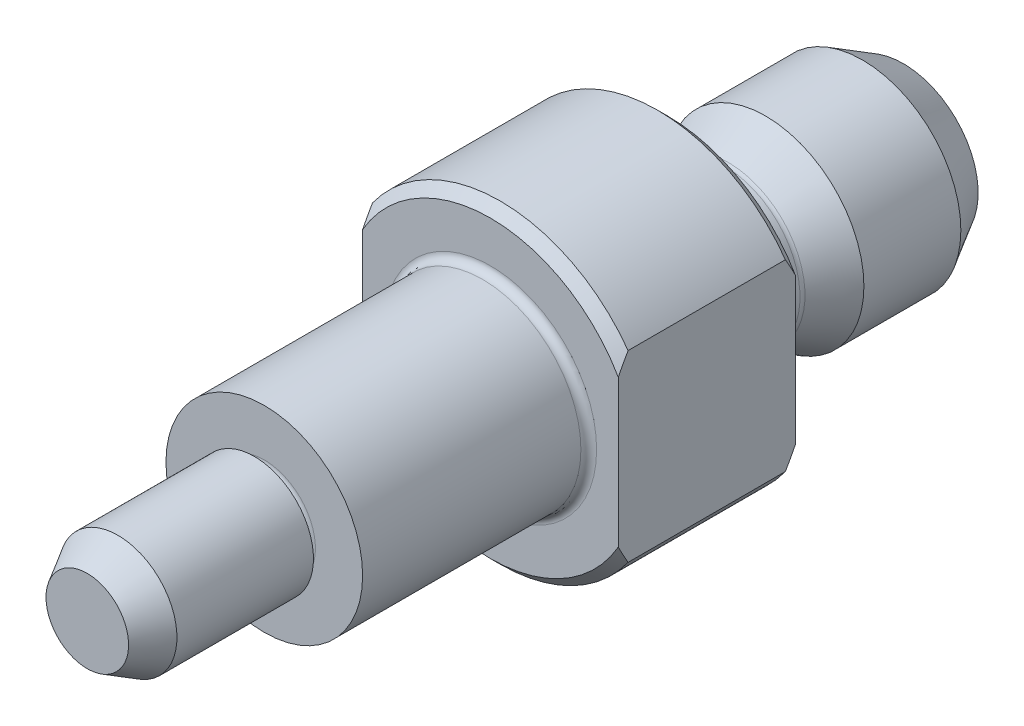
ISO-10303-21;
HEADER;
FILE_DESCRIPTION(('STEP AP214'),'2;1');
FILE_NAME('part.step','',(''),(''),'','','');
FILE_SCHEMA(('AUTOMOTIVE_DESIGN { 1 0 10303 214 1 1 1 1 }'));
ENDSEC;
DATA;
#1=APPLICATION_CONTEXT('core data for automotive mechanical design processes');
#2=APPLICATION_PROTOCOL_DEFINITION('international standard','automotive_design',2000,#1);
#3=PRODUCT_CONTEXT('',#1,'mechanical');
#4=PRODUCT('Part','Part','',(#3));
#5=PRODUCT_RELATED_PRODUCT_CATEGORY('part','',(#4));
#6=PRODUCT_DEFINITION_FORMATION('','',#4);
#7=PRODUCT_DEFINITION_CONTEXT('part definition',#1,'design');
#8=PRODUCT_DEFINITION('design','',#6,#7);
#9=PRODUCT_DEFINITION_SHAPE('','',#8);
#10=(LENGTH_UNIT() NAMED_UNIT(*) SI_UNIT(.MILLI.,.METRE.));
#11=(NAMED_UNIT(*) PLANE_ANGLE_UNIT() SI_UNIT($,.RADIAN.));
#12=(NAMED_UNIT(*) SI_UNIT($,.STERADIAN.) SOLID_ANGLE_UNIT());
#13=UNCERTAINTY_MEASURE_WITH_UNIT(LENGTH_MEASURE(1.E-05),#10,'distance_accuracy_value','');
#14=(GEOMETRIC_REPRESENTATION_CONTEXT(3) GLOBAL_UNCERTAINTY_ASSIGNED_CONTEXT((#13)) GLOBAL_UNIT_ASSIGNED_CONTEXT((#10,
#11,#12)) REPRESENTATION_CONTEXT('',''));
#15=CARTESIAN_POINT('',(0.,0.,0.));
#16=DIRECTION('',(0.,0.,1.));
#17=DIRECTION('',(1.,0.,0.));
#18=AXIS2_PLACEMENT_3D('',#15,#16,#17);
#19=CARTESIAN_POINT('',(0.,4.25000000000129,0.));
#20=DIRECTION('',(0.,0.,-1.));
#21=DIRECTION('',(-1.,0.,0.));
#22=AXIS2_PLACEMENT_3D('',#19,#20,#21);
#23=PLANE('',#22);
#24=CARTESIAN_POINT('',(0.,0.,0.));
#25=DIRECTION('',(0.,0.,-1.));
#26=DIRECTION('',(-1.,0.,0.));
#27=AXIS2_PLACEMENT_3D('',#24,#25,#26);
#28=CIRCLE('',#27,4.25000000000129);
#29=CARTESIAN_POINT('',(-4.25000000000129,0.,0.));
#30=VERTEX_POINT('',#29);
#31=EDGE_CURVE('E111',#30,#30,#28,.T.);
#32=ORIENTED_EDGE('',*,*,#31,.F.);
#33=EDGE_LOOP('',(#32));
#34=FACE_BOUND('',#33,.T.);
#35=CARTESIAN_POINT('',(0.,0.,0.));
#36=DIRECTION('',(0.,0.,-1.));
#37=DIRECTION('',(-1.,0.,0.));
#38=AXIS2_PLACEMENT_3D('',#35,#36,#37);
#39=CIRCLE('',#38,7.5);
#40=CARTESIAN_POINT('',(-6.5,3.74165738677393,0.));
#41=VERTEX_POINT('',#40);
#42=CARTESIAN_POINT('',(6.5,3.74165738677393,0.));
#43=VERTEX_POINT('',#42);
#44=EDGE_CURVE('E108',#41,#43,#39,.T.);
#45=ORIENTED_EDGE('',*,*,#44,.T.);
#46=DIRECTION('',(0.,-1.,0.));
#47=VECTOR('',#46,1.);
#48=CARTESIAN_POINT('',(6.5,4.6636895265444,0.));
#49=LINE('',#48,#47);
#50=CARTESIAN_POINT('',(6.5,-3.74165738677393,0.));
#51=VERTEX_POINT('',#50);
#52=EDGE_CURVE('E408',#43,#51,#49,.T.);
#53=ORIENTED_EDGE('',*,*,#52,.T.);
#54=CARTESIAN_POINT('',(-6.5,-3.74165738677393,0.));
#55=VERTEX_POINT('',#54);
#56=EDGE_CURVE('E107',#51,#55,#39,.T.);
#57=ORIENTED_EDGE('',*,*,#56,.T.);
#58=DIRECTION('',(0.,1.,0.));
#59=VECTOR('',#58,1.);
#60=CARTESIAN_POINT('',(-6.5,4.6636895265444,0.));
#61=LINE('',#60,#59);
#62=EDGE_CURVE('E91',#55,#41,#61,.T.);
#63=ORIENTED_EDGE('',*,*,#62,.T.);
#64=EDGE_LOOP('',(#45,#53,#57,#63));
#65=FACE_BOUND('',#64,.T.);
#66=ADVANCED_FACE('F14',(#34,#65),#23,.T.);
#67=CARTESIAN_POINT('',(0.,0.,0.));
#68=DIRECTION('',(0.,0.,1.));
#69=DIRECTION('',(1.,0.,0.));
#70=AXIS2_PLACEMENT_3D('',#67,#68,#69);
#71=CONICAL_SURFACE('',#70,7.5,0.785398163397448);
#72=ORIENTED_EDGE('',*,*,#56,.F.);
#73=CARTESIAN_POINT('',(6.5,-0.448442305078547,-0.9845490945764));
#74=CARTESIAN_POINT('',(6.5,-0.554436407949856,-0.977262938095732));
#75=CARTESIAN_POINT('',(6.5,-0.660232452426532,-0.967396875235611));
#76=CARTESIAN_POINT('',(6.5,-0.87121683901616,-0.942708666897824));
#77=CARTESIAN_POINT('',(6.5,-0.976405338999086,-0.927887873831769));
#78=CARTESIAN_POINT('',(6.5,-1.29037820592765,-0.876364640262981));
#79=CARTESIAN_POINT('',(6.5,-1.49802720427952,-0.832568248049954));
#80=CARTESIAN_POINT('',(6.5,-1.906698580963,-0.728973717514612));
#81=CARTESIAN_POINT('',(6.5,-2.10776929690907,-0.669361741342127));
#82=CARTESIAN_POINT('',(6.5,-2.50533852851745,-0.536408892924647));
#83=CARTESIAN_POINT('',(6.5,-2.70183584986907,-0.463064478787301));
#84=CARTESIAN_POINT('',(6.5,-3.0217554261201,-0.332865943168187));
#85=CARTESIAN_POINT('',(6.5,-3.14653861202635,-0.27930281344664));
#86=CARTESIAN_POINT('',(6.5,-3.33245316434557,-0.195743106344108));
#87=CARTESIAN_POINT('',(6.5,-3.39429257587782,-0.167315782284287));
#88=CARTESIAN_POINT('',(6.5,-3.51750334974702,-0.109473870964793));
#89=CARTESIAN_POINT('',(6.5,-3.57887473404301,-0.0800593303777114));
#90=CARTESIAN_POINT('',(6.5,-3.93683654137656,0.0948343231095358));
#91=CARTESIAN_POINT('',(6.5,-4.22838435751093,0.250719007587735));
#92=CARTESIAN_POINT('',(6.5,-4.80252151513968,0.57828162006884));
#93=CARTESIAN_POINT('',(6.5,-5.08510521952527,0.74996923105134));
#94=CARTESIAN_POINT('',(6.5,-5.64369197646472,1.10550730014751));
#95=CARTESIAN_POINT('',(6.5,-5.91967220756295,1.28939342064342));
#96=CARTESIAN_POINT('',(6.5,-6.46548469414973,1.66588745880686));
#97=CARTESIAN_POINT('',(6.5,-6.73531832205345,1.85849340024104));
#98=CARTESIAN_POINT('',(6.5,-7.263233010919,2.24541762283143));
#99=CARTESIAN_POINT('',(6.5,-7.52143831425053,2.43956706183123));
#100=CARTESIAN_POINT('',(6.5,-8.03402105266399,2.83288508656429));
#101=CARTESIAN_POINT('',(6.5,-8.28839816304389,3.03205409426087));
#102=CARTESIAN_POINT('',(6.5,-8.79211203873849,3.43289007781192));
#103=CARTESIAN_POINT('',(6.5,-9.0414721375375,3.6345278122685));
#104=CARTESIAN_POINT('',(6.5,-9.53750816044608,4.0409767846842));
#105=CARTESIAN_POINT('',(6.5,-9.78418463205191,4.24578735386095));
#106=CARTESIAN_POINT('',(6.5,-10.0297939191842,4.45185199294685));
#107=B_SPLINE_CURVE_WITH_KNOTS('',3,(#73,#74,#75,#76,#77,#78,#79,#80,#81,#82,#83,#84,#85,#86,
#87,#88,#89,#90,#91,#92,#93,#94,#95,#96,#97,#98,#99,#100,#101,#102,#103,#104,#105,#106),
.UNSPECIFIED.,.F.,.F.,(4,2,2,2,2,2,2,2,2,2,2,2,2,2,2,2,4),(0.,0.318664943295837,
0.637242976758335,1.27302900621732,1.90164000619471,2.53041336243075,2.93771707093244,
3.14188952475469,3.34605233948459,4.33706569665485,5.32869037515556,6.323354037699,
7.31779339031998,8.28688010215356,9.25604855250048,10.2180718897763,11.1798951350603),.UNSPECIFIED.);
#108=CARTESIAN_POINT('',(6.5,-4.6636895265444,0.5));
#109=VERTEX_POINT('',#108);
#110=EDGE_CURVE('E464',#51,#109,#107,.T.);
#111=ORIENTED_EDGE('',*,*,#110,.T.);
#112=CARTESIAN_POINT('',(0.,0.,0.5));
#113=DIRECTION('',(0.,0.,-1.));
#114=DIRECTION('',(-1.,0.,0.));
#115=AXIS2_PLACEMENT_3D('',#112,#113,#114);
#116=CIRCLE('',#115,8.);
#117=CARTESIAN_POINT('',(-6.5,-4.6636895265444,0.5));
#118=VERTEX_POINT('',#117);
#119=EDGE_CURVE('E103',#109,#118,#116,.T.);
#120=ORIENTED_EDGE('',*,*,#119,.T.);
#121=CARTESIAN_POINT('',(-6.5,-10.0297939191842,4.45185199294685));
#122=CARTESIAN_POINT('',(-6.5,-9.77580964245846,4.23876654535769));
#123=CARTESIAN_POINT('',(-6.5,-9.52068711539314,4.02701683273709));
#124=CARTESIAN_POINT('',(-6.5,-9.00755072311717,3.60693105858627));
#125=CARTESIAN_POINT('',(-6.5,-8.74953620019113,3.398595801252));
#126=CARTESIAN_POINT('',(-6.5,-8.22831564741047,2.98474942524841));
#127=CARTESIAN_POINT('',(-6.5,-7.96508601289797,2.77926794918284));
#128=CARTESIAN_POINT('',(-6.5,-7.43445589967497,2.37379363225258));
#129=CARTESIAN_POINT('',(-6.5,-7.16705579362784,2.17380030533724));
#130=CARTESIAN_POINT('',(-6.5,-6.63798977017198,1.78877409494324));
#131=CARTESIAN_POINT('',(-6.5,-6.37652699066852,1.60346310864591));
#132=CARTESIAN_POINT('',(-6.5,-5.84774950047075,1.24122617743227));
#133=CARTESIAN_POINT('',(-6.5,-5.58043372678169,1.0643017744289));
#134=CARTESIAN_POINT('',(-6.5,-5.03931289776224,0.721972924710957));
#135=CARTESIAN_POINT('',(-6.5,-4.76552352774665,0.556543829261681));
#136=CARTESIAN_POINT('',(-6.5,-4.20948094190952,0.240630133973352));
#137=CARTESIAN_POINT('',(-6.5,-3.92723176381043,0.0901385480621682));
#138=CARTESIAN_POINT('',(-6.5,-3.51578659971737,-0.110881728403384));
#139=CARTESIAN_POINT('',(-6.5,-3.39062252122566,-0.169677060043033));
#140=CARTESIAN_POINT('',(-6.5,-3.13834790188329,-0.282902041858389));
#141=CARTESIAN_POINT('',(-6.5,-3.01123741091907,-0.337331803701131));
#142=CARTESIAN_POINT('',(-6.5,-2.62717157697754,-0.493051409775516));
#143=CARTESIAN_POINT('',(-6.5,-2.3671028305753,-0.586960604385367));
#144=CARTESIAN_POINT('',(-6.5,-1.96906704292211,-0.709495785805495));
#145=CARTESIAN_POINT('',(-6.5,-1.8339537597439,-0.747514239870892));
#146=CARTESIAN_POINT('',(-6.5,-1.56189192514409,-0.816274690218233));
#147=CARTESIAN_POINT('',(-6.5,-1.42494369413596,-0.847017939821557));
#148=CARTESIAN_POINT('',(-6.5,-1.14875341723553,-0.900664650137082));
#149=CARTESIAN_POINT('',(-6.5,-1.00950305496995,-0.923525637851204));
#150=CARTESIAN_POINT('',(-6.5,-0.72976611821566,-0.960642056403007));
#151=CARTESIAN_POINT('',(-6.5,-0.589278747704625,-0.974891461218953));
#152=CARTESIAN_POINT('',(-6.5,-0.448442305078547,-0.9845490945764));
#153=B_SPLINE_CURVE_WITH_KNOTS('',3,(#121,#122,#123,#124,#125,#126,#127,#128,#129,#130,#131,
#132,#133,#134,#135,#136,#137,#138,#139,#140,#141,#142,#143,#144,#145,#146,#147,#148,#149,#150,
#151,#152),.UNSPECIFIED.,.F.,.F.,(4,2,2,2,2,2,2,2,2,2,2,2,2,2,2,4),(0.,0.994611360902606,
1.98945370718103,2.99120180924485,3.99286090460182,4.95415669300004,5.9156285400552,
6.87497072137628,7.83386209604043,8.24864290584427,8.66341310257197,9.49168550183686,
9.91260568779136,10.3334533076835,10.7565344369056,11.1799112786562),.UNSPECIFIED.);
#154=EDGE_CURVE('E440',#118,#55,#153,.T.);
#155=ORIENTED_EDGE('',*,*,#154,.T.);
#156=EDGE_LOOP('',(#72,#111,#120,#155));
#157=FACE_BOUND('',#156,.T.);
#158=ADVANCED_FACE('F154',(#157),#71,.T.);
#159=CARTESIAN_POINT('',(-6.5,4.6636895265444,0.5));
#160=VERTEX_POINT('',#159);
#161=CARTESIAN_POINT('',(6.5,4.6636895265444,0.5));
#162=VERTEX_POINT('',#161);
#163=EDGE_CURVE('E104',#160,#162,#116,.T.);
#164=ORIENTED_EDGE('',*,*,#163,.T.);
#165=CARTESIAN_POINT('',(6.5,10.0297939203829,4.4518519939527));
#166=CARTESIAN_POINT('',(6.5,9.77580964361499,4.2387665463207));
#167=CARTESIAN_POINT('',(6.5,9.52068711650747,4.02701683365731));
#168=CARTESIAN_POINT('',(6.5,9.0075507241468,3.60693105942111));
#169=CARTESIAN_POINT('',(6.5,8.74953620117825,3.39859580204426));
#170=CARTESIAN_POINT('',(6.5,8.22831564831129,2.98474942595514));
#171=CARTESIAN_POINT('',(6.5,7.96508601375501,2.77926794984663));
#172=CARTESIAN_POINT('',(6.5,7.43445590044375,2.37379363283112));
#173=CARTESIAN_POINT('',(6.5,7.16705579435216,2.17380030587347));
#174=CARTESIAN_POINT('',(6.5,6.63798977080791,1.78877409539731));
#175=CARTESIAN_POINT('',(6.5,6.37652699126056,1.60346310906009));
#176=CARTESIAN_POINT('',(6.5,5.84774950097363,1.24122617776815));
#177=CARTESIAN_POINT('',(6.5,5.58043372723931,1.06430177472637));
#178=CARTESIAN_POINT('',(6.5,5.03931289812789,0.721972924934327));
#179=CARTESIAN_POINT('',(6.5,4.76552352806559,0.556543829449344));
#180=CARTESIAN_POINT('',(6.5,4.20948094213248,0.240630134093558));
#181=CARTESIAN_POINT('',(6.5,3.92723176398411,0.0901385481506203));
#182=CARTESIAN_POINT('',(6.5,3.51578659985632,-0.110881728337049));
#183=CARTESIAN_POINT('',(6.5,3.39062252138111,-0.16967705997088));
#184=CARTESIAN_POINT('',(6.5,3.13834790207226,-0.28290204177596));
#185=CARTESIAN_POINT('',(6.5,3.01123741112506,-0.337331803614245));
#186=CARTESIAN_POINT('',(6.5,2.62717157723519,-0.493051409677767));
#187=CARTESIAN_POINT('',(6.5,2.36710283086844,-0.586960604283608));
#188=CARTESIAN_POINT('',(6.5,1.9690670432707,-0.709495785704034));
#189=CARTESIAN_POINT('',(6.5,1.8339537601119,-0.747514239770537));
#190=CARTESIAN_POINT('',(6.5,1.56189192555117,-0.816274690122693));
#191=CARTESIAN_POINT('',(6.5,1.42494369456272,-0.847017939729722));
#192=CARTESIAN_POINT('',(6.5,1.14875341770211,-0.900664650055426));
#193=CARTESIAN_POINT('',(6.5,1.00950305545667,-0.923525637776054));
#194=CARTESIAN_POINT('',(6.5,0.729766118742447,-0.960642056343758));
#195=CARTESIAN_POINT('',(6.5,0.589278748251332,-0.974891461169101));
#196=CARTESIAN_POINT('',(6.5,0.448442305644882,-0.9845490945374));
#197=B_SPLINE_CURVE_WITH_KNOTS('',3,(#165,#166,#167,#168,#169,#170,#171,#172,#173,#174,#175,
#176,#177,#178,#179,#180,#181,#182,#183,#184,#185,#186,#187,#188,#189,#190,#191,#192,#193,#194,
#195,#196),.UNSPECIFIED.,.F.,.F.,(4,2,2,2,2,2,2,2,2,2,2,2,2,2,2,4),(0.,0.994611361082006,
1.98945370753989,2.99120180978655,3.99286090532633,4.95415669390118,5.91562854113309,
6.87497072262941,7.83386209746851,8.24864290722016,8.66341310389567,9.49168550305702,
9.91260568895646,10.3334533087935,10.7565344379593,11.1799112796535),.UNSPECIFIED.);
#198=EDGE_CURVE('E403',#162,#43,#197,.T.);
#199=ORIENTED_EDGE('',*,*,#198,.T.);
#200=ORIENTED_EDGE('',*,*,#44,.F.);
#201=CARTESIAN_POINT('',(-6.5,0.448442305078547,-0.9845490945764));
#202=CARTESIAN_POINT('',(-6.5,0.554436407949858,-0.977262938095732));
#203=CARTESIAN_POINT('',(-6.5,0.660232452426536,-0.967396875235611));
#204=CARTESIAN_POINT('',(-6.5,0.871216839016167,-0.942708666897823));
#205=CARTESIAN_POINT('',(-6.5,0.976405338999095,-0.927887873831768));
#206=CARTESIAN_POINT('',(-6.5,1.29037820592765,-0.876364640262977));
#207=CARTESIAN_POINT('',(-6.5,1.49802720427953,-0.832568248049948));
#208=CARTESIAN_POINT('',(-6.5,1.90669858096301,-0.728973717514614));
#209=CARTESIAN_POINT('',(-6.5,2.10776929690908,-0.669361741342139));
#210=CARTESIAN_POINT('',(-6.5,2.50533852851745,-0.536408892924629));
#211=CARTESIAN_POINT('',(-6.5,2.70183584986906,-0.463064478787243));
#212=CARTESIAN_POINT('',(-6.5,3.0217554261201,-0.332865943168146));
#213=CARTESIAN_POINT('',(-6.5,3.14653861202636,-0.279302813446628));
#214=CARTESIAN_POINT('',(-6.5,3.33245316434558,-0.195743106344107));
#215=CARTESIAN_POINT('',(-6.5,3.39429257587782,-0.167315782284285));
#216=CARTESIAN_POINT('',(-6.5,3.51750334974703,-0.109473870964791));
#217=CARTESIAN_POINT('',(-6.5,3.57887473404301,-0.0800593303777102));
#218=CARTESIAN_POINT('',(-6.5,3.93683654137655,0.0948343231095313));
#219=CARTESIAN_POINT('',(-6.5,4.22838435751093,0.250719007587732));
#220=CARTESIAN_POINT('',(-6.5,4.80252151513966,0.578281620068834));
#221=CARTESIAN_POINT('',(-6.5,5.08510521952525,0.74996923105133));
#222=CARTESIAN_POINT('',(-6.5,5.64369197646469,1.10550730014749));
#223=CARTESIAN_POINT('',(-6.5,5.91967220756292,1.2893934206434));
#224=CARTESIAN_POINT('',(-6.5,6.46548469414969,1.66588745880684));
#225=CARTESIAN_POINT('',(-6.5,6.73531832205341,1.85849340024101));
#226=CARTESIAN_POINT('',(-6.5,7.26323301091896,2.2454176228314));
#227=CARTESIAN_POINT('',(-6.5,7.5214383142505,2.43956706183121));
#228=CARTESIAN_POINT('',(-6.5,8.03402105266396,2.83288508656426));
#229=CARTESIAN_POINT('',(-6.5,8.28839816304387,3.03205409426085));
#230=CARTESIAN_POINT('',(-6.5,8.79211203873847,3.4328900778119));
#231=CARTESIAN_POINT('',(-6.5,9.04147213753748,3.63452781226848));
#232=CARTESIAN_POINT('',(-6.5,9.53750816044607,4.04097678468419));
#233=CARTESIAN_POINT('',(-6.5,9.7841846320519,4.24578735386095));
#234=CARTESIAN_POINT('',(-6.5,10.0297939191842,4.45185199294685));
#235=B_SPLINE_CURVE_WITH_KNOTS('',3,(#201,#202,#203,#204,#205,#206,#207,#208,#209,#210,#211,
#212,#213,#214,#215,#216,#217,#218,#219,#220,#221,#222,#223,#224,#225,#226,#227,#228,#229,#230,
#231,#232,#233,#234),.UNSPECIFIED.,.F.,.F.,(4,2,2,2,2,2,2,2,2,2,2,2,2,2,2,2,4),(0.,
0.318664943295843,0.637242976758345,1.27302900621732,1.90164000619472,2.53041336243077,
2.93771707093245,3.1418895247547,3.34605233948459,4.33706569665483,5.32869037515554,
6.32335403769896,7.31779339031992,8.28688010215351,9.25604855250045,10.2180718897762,
11.1798951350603),.UNSPECIFIED.);
#236=EDGE_CURVE('E404',#41,#160,#235,.T.);
#237=ORIENTED_EDGE('',*,*,#236,.T.);
#238=EDGE_LOOP('',(#164,#199,#200,#237));
#239=FACE_BOUND('',#238,.T.);
#240=ADVANCED_FACE('F161',(#239),#71,.T.);
#241=CARTESIAN_POINT('',(0.,0.,-25.8155281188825));
#242=DIRECTION('',(0.,0.,-1.));
#243=DIRECTION('',(-1.,0.,0.));
#244=AXIS2_PLACEMENT_3D('',#241,#242,#243);
#245=CYLINDRICAL_SURFACE('',#244,8.);
#246=ORIENTED_EDGE('',*,*,#119,.F.);
#247=DIRECTION('',(0.,0.,-1.));
#248=VECTOR('',#247,1.);
#249=CARTESIAN_POINT('',(6.5,-4.6636895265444,29.6155281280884));
#250=LINE('',#249,#248);
#251=CARTESIAN_POINT('',(6.5,-4.6636895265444,8.5));
#252=VERTEX_POINT('',#251);
#253=EDGE_CURVE('E409',#252,#109,#250,.T.);
#254=ORIENTED_EDGE('',*,*,#253,.F.);
#255=CARTESIAN_POINT('',(0.,0.,8.5));
#256=DIRECTION('',(0.,0.,-1.));
#257=DIRECTION('',(-1.,0.,0.));
#258=AXIS2_PLACEMENT_3D('',#255,#256,#257);
#259=CIRCLE('',#258,8.);
#260=CARTESIAN_POINT('',(-6.5,-4.6636895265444,8.5));
#261=VERTEX_POINT('',#260);
#262=EDGE_CURVE('E94',#252,#261,#259,.T.);
#263=ORIENTED_EDGE('',*,*,#262,.T.);
#264=DIRECTION('',(0.,0.,-1.));
#265=VECTOR('',#264,1.);
#266=CARTESIAN_POINT('',(-6.5,-4.6636895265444,29.6155281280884));
#267=LINE('',#266,#265);
#268=EDGE_CURVE('E417',#261,#118,#267,.T.);
#269=ORIENTED_EDGE('',*,*,#268,.T.);
#270=EDGE_LOOP('',(#246,#254,#263,#269));
#271=FACE_BOUND('',#270,.T.);
#272=ADVANCED_FACE('F345',(#271),#245,.T.);
#273=CARTESIAN_POINT('',(-6.5,4.6636895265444,8.5));
#274=VERTEX_POINT('',#273);
#275=CARTESIAN_POINT('',(6.5,4.6636895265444,8.5));
#276=VERTEX_POINT('',#275);
#277=EDGE_CURVE('E90',#274,#276,#259,.T.);
#278=ORIENTED_EDGE('',*,*,#277,.T.);
#279=DIRECTION('',(0.,0.,-1.));
#280=VECTOR('',#279,1.);
#281=CARTESIAN_POINT('',(6.5,4.6636895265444,29.6155281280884));
#282=LINE('',#281,#280);
#283=EDGE_CURVE('E407',#276,#162,#282,.T.);
#284=ORIENTED_EDGE('',*,*,#283,.T.);
#285=ORIENTED_EDGE('',*,*,#163,.F.);
#286=DIRECTION('',(0.,0.,-1.));
#287=VECTOR('',#286,1.);
#288=CARTESIAN_POINT('',(-6.5,4.6636895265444,29.6155281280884));
#289=LINE('',#288,#287);
#290=EDGE_CURVE('E406',#274,#160,#289,.T.);
#291=ORIENTED_EDGE('',*,*,#290,.F.);
#292=EDGE_LOOP('',(#278,#284,#285,#291));
#293=FACE_BOUND('',#292,.T.);
#294=ADVANCED_FACE('F336',(#293),#245,.T.);
#295=CARTESIAN_POINT('',(0.,0.,8.5));
#296=DIRECTION('',(0.,0.,-1.));
#297=DIRECTION('',(-1.,0.,0.));
#298=AXIS2_PLACEMENT_3D('',#295,#296,#297);
#299=CONICAL_SURFACE('',#298,8.,0.785398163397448);
#300=ORIENTED_EDGE('',*,*,#262,.F.);
#301=CARTESIAN_POINT('',(6.5,-10.0297939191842,4.54814800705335));
#302=CARTESIAN_POINT('',(6.5,-9.7758096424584,4.76123345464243));
#303=CARTESIAN_POINT('',(6.5,-9.52068711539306,4.97298316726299));
#304=CARTESIAN_POINT('',(6.5,-9.00755072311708,5.39306894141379));
#305=CARTESIAN_POINT('',(6.5,-8.74953620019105,5.60140419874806));
#306=CARTESIAN_POINT('',(6.5,-8.22831564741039,6.01525057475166));
#307=CARTESIAN_POINT('',(6.5,-7.96508601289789,6.22073205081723));
#308=CARTESIAN_POINT('',(6.5,-7.43445589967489,6.62620636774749));
#309=CARTESIAN_POINT('',(6.5,-7.16705579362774,6.82619969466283));
#310=CARTESIAN_POINT('',(6.5,-6.63798977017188,7.21122590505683));
#311=CARTESIAN_POINT('',(6.5,-6.37652699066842,7.39653689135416));
#312=CARTESIAN_POINT('',(6.5,-5.84774950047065,7.75877382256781));
#313=CARTESIAN_POINT('',(6.5,-5.5804337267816,7.93569822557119));
#314=CARTESIAN_POINT('',(6.5,-5.03931289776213,8.27802707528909));
#315=CARTESIAN_POINT('',(6.5,-4.76552352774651,8.44345617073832));
#316=CARTESIAN_POINT('',(6.5,-4.20948094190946,8.75936986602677));
#317=CARTESIAN_POINT('',(6.5,-3.92723176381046,8.90986145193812));
#318=CARTESIAN_POINT('',(6.5,-3.51578659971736,9.11088172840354));
#319=CARTESIAN_POINT('',(6.5,-3.39062252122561,9.1696770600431));
#320=CARTESIAN_POINT('',(6.5,-3.13834790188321,9.28290204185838));
#321=CARTESIAN_POINT('',(6.5,-3.01123741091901,9.33733180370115));
#322=CARTESIAN_POINT('',(6.5,-2.6271715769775,9.49305140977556));
#323=CARTESIAN_POINT('',(6.5,-2.36710283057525,9.58696060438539));
#324=CARTESIAN_POINT('',(6.5,-1.96906704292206,9.70949578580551));
#325=CARTESIAN_POINT('',(6.5,-1.83395375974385,9.7475142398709));
#326=CARTESIAN_POINT('',(6.5,-1.56189192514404,9.81627469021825));
#327=CARTESIAN_POINT('',(6.5,-1.42494369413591,9.84701793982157));
#328=CARTESIAN_POINT('',(6.5,-1.14875341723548,9.90066465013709));
#329=CARTESIAN_POINT('',(6.5,-1.0095030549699,9.9235256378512));
#330=CARTESIAN_POINT('',(6.5,-0.729766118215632,9.96064205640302));
#331=CARTESIAN_POINT('',(6.5,-0.589278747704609,9.97489146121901));
#332=CARTESIAN_POINT('',(6.5,-0.448442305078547,9.98454909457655));
#333=B_SPLINE_CURVE_WITH_KNOTS('',3,(#301,#302,#303,#304,#305,#306,#307,#308,#309,#310,#311,
#312,#313,#314,#315,#316,#317,#318,#319,#320,#321,#322,#323,#324,#325,#326,#327,#328,#329,#330,
#331,#332),.UNSPECIFIED.,.F.,.F.,(4,2,2,2,2,2,2,2,2,2,2,2,2,2,2,4),(0.,0.994611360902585,
1.98945370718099,2.99120180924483,3.99286090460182,4.95415669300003,5.9156285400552,
6.87497072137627,7.8338620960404,8.24864290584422,8.66341310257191,9.4916855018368,
9.9126056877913,10.3334533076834,10.7565344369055,11.1799112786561),.UNSPECIFIED.);
#334=CARTESIAN_POINT('',(6.5,-3.74165738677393,9.));
#335=VERTEX_POINT('',#334);
#336=EDGE_CURVE('E452',#252,#335,#333,.T.);
#337=ORIENTED_EDGE('',*,*,#336,.T.);
#338=CARTESIAN_POINT('',(0.,0.,9.));
#339=DIRECTION('',(0.,0.,-1.));
#340=DIRECTION('',(-1.,0.,0.));
#341=AXIS2_PLACEMENT_3D('',#338,#339,#340);
#342=CIRCLE('',#341,7.5);
#343=CARTESIAN_POINT('',(-6.5,-3.74165738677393,9.));
#344=VERTEX_POINT('',#343);
#345=EDGE_CURVE('E95',#335,#344,#342,.T.);
#346=ORIENTED_EDGE('',*,*,#345,.T.);
#347=CARTESIAN_POINT('',(-6.5,-0.448442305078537,9.98454909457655));
#348=CARTESIAN_POINT('',(-6.5,-0.55443640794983,9.97726293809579));
#349=CARTESIAN_POINT('',(-6.5,-0.660232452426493,9.96739687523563));
#350=CARTESIAN_POINT('',(-6.5,-0.871216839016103,9.94270866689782));
#351=CARTESIAN_POINT('',(-6.5,-0.976405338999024,9.92788787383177));
#352=CARTESIAN_POINT('',(-6.5,-1.29037820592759,9.876364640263));
#353=CARTESIAN_POINT('',(-6.5,-1.49802720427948,9.83256824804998));
#354=CARTESIAN_POINT('',(-6.5,-1.90669858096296,9.72897371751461));
#355=CARTESIAN_POINT('',(-6.5,-2.10776929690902,9.6693617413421));
#356=CARTESIAN_POINT('',(-6.5,-2.50533852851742,9.5364088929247));
#357=CARTESIAN_POINT('',(-6.5,-2.70183584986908,9.46306447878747));
#358=CARTESIAN_POINT('',(-6.5,-3.02175542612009,9.33286594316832));
#359=CARTESIAN_POINT('',(-6.5,-3.14653861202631,9.2793028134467));
#360=CARTESIAN_POINT('',(-6.5,-3.3324531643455,9.19574310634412));
#361=CARTESIAN_POINT('',(-6.5,-3.39429257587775,9.16731578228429));
#362=CARTESIAN_POINT('',(-6.5,-3.51750334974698,9.10947387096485));
#363=CARTESIAN_POINT('',(-6.5,-3.57887473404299,9.08005933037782));
#364=CARTESIAN_POINT('',(-6.5,-3.93683654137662,8.9051656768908));
#365=CARTESIAN_POINT('',(-6.5,-4.22838435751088,8.74928099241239));
#366=CARTESIAN_POINT('',(-6.5,-4.80252151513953,8.42171837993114));
#367=CARTESIAN_POINT('',(-6.5,-5.08510521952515,8.25003076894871));
#368=CARTESIAN_POINT('',(-6.5,-5.64369197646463,7.89449269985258));
#369=CARTESIAN_POINT('',(-6.5,-5.91967220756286,7.71060657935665));
#370=CARTESIAN_POINT('',(-6.5,-6.46548469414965,7.33411254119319));
#371=CARTESIAN_POINT('',(-6.5,-6.73531832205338,7.14150659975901));
#372=CARTESIAN_POINT('',(-6.5,-7.26323301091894,6.75458237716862));
#373=CARTESIAN_POINT('',(-6.5,-7.52143831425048,6.56043293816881));
#374=CARTESIAN_POINT('',(-6.5,-8.03402105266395,6.16711491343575));
#375=CARTESIAN_POINT('',(-6.5,-8.28839816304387,5.96794590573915));
#376=CARTESIAN_POINT('',(-6.5,-8.79211203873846,5.5671099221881));
#377=CARTESIAN_POINT('',(-6.5,-9.04147213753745,5.36547218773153));
#378=CARTESIAN_POINT('',(-6.5,-9.53750816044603,4.95902321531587));
#379=CARTESIAN_POINT('',(-6.5,-9.78418463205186,4.75421264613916));
#380=CARTESIAN_POINT('',(-6.5,-10.0297939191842,4.54814800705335));
#381=B_SPLINE_CURVE_WITH_KNOTS('',3,(#347,#348,#349,#350,#351,#352,#353,#354,#355,#356,#357,
#358,#359,#360,#361,#362,#363,#364,#365,#366,#367,#368,#369,#370,#371,#372,#373,#374,#375,#376,
#377,#378,#379,#380),.UNSPECIFIED.,.F.,.F.,(4,2,2,2,2,2,2,2,2,2,2,2,2,2,2,2,4),(0.,
0.318664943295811,0.63724297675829,1.2730290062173,1.9016400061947,2.53041336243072,
2.93771707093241,3.14188952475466,3.34605233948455,4.33706569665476,5.32869037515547,
6.32335403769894,7.31779339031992,8.28688010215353,9.25604855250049,10.2180718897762,
11.1798951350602),.UNSPECIFIED.);
#382=EDGE_CURVE('E29',#344,#261,#381,.T.);
#383=ORIENTED_EDGE('',*,*,#382,.T.);
#384=EDGE_LOOP('',(#300,#337,#346,#383));
#385=FACE_BOUND('',#384,.T.);
#386=ADVANCED_FACE('F327',(#385),#299,.T.);
#387=CARTESIAN_POINT('',(-6.5,3.74165738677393,9.));
#388=VERTEX_POINT('',#387);
#389=CARTESIAN_POINT('',(6.5,3.74165738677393,9.));
#390=VERTEX_POINT('',#389);
#391=EDGE_CURVE('E88',#388,#390,#342,.T.);
#392=ORIENTED_EDGE('',*,*,#391,.T.);
#393=CARTESIAN_POINT('',(6.5,0.44844230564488,9.9845490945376));
#394=CARTESIAN_POINT('',(6.5,0.554436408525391,9.97726293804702));
#395=CARTESIAN_POINT('',(6.5,0.660232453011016,9.96739687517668));
#396=CARTESIAN_POINT('',(6.5,0.871216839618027,9.94270866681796));
#397=CARTESIAN_POINT('',(6.5,0.976405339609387,9.92788787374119));
#398=CARTESIAN_POINT('',(6.5,1.29037820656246,9.87636464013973));
#399=CARTESIAN_POINT('',(6.5,1.49802720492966,9.83256824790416));
#400=CARTESIAN_POINT('',(6.5,1.90669858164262,9.7289737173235));
#401=CARTESIAN_POINT('',(6.5,2.10776929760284,9.66936174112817));
#402=CARTESIAN_POINT('',(6.5,2.50533852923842,9.53640889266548));
#403=CARTESIAN_POINT('',(6.5,2.70183585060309,9.46306447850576));
#404=CARTESIAN_POINT('',(6.5,3.02175542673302,9.33286594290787));
#405=CARTESIAN_POINT('',(6.5,3.1465386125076,9.27930281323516));
#406=CARTESIAN_POINT('',(6.5,3.33245316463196,9.19574310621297));
#407=CARTESIAN_POINT('',(6.5,3.39429257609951,9.16731578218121));
#408=CARTESIAN_POINT('',(6.5,3.51750334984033,9.10947387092));
#409=CARTESIAN_POINT('',(6.5,3.57887473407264,9.08005933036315));
#410=CARTESIAN_POINT('',(6.5,3.93683654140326,8.90516567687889));
#411=CARTESIAN_POINT('',(6.5,4.2283843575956,8.74928099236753));
#412=CARTESIAN_POINT('',(6.5,4.80252151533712,8.42171837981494));
#413=CARTESIAN_POINT('',(6.5,5.08510521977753,8.25003076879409));
#414=CARTESIAN_POINT('',(6.5,5.64369197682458,7.89449269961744));
#415=CARTESIAN_POINT('',(6.5,5.91967220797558,7.71060657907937));
#416=CARTESIAN_POINT('',(6.5,6.46548469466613,7.33411254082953));
#417=CARTESIAN_POINT('',(6.5,6.73531832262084,7.14150659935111));
#418=CARTESIAN_POINT('',(6.5,7.26323301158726,6.754582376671));
#419=CARTESIAN_POINT('',(6.5,7.52143831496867,6.56043293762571));
#420=CARTESIAN_POINT('',(6.5,8.03402105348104,6.16711491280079));
#421=CARTESIAN_POINT('',(6.5,8.28839816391,5.96794590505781));
#422=CARTESIAN_POINT('',(6.5,8.7921120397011,5.56710992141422));
#423=CARTESIAN_POINT('',(6.5,9.04147213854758,5.3654721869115));
#424=CARTESIAN_POINT('',(6.5,9.53750816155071,4.95902321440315));
#425=CARTESIAN_POINT('',(6.5,9.78418463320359,4.75421264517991));
#426=CARTESIAN_POINT('',(6.5,10.0297939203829,4.54814800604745));
#427=B_SPLINE_CURVE_WITH_KNOTS('',3,(#393,#394,#395,#396,#397,#398,#399,#400,#401,#402,#403,
#404,#405,#406,#407,#408,#409,#410,#411,#412,#413,#414,#415,#416,#417,#418,#419,#420,#421,#422,
#423,#424,#425,#426),.UNSPECIFIED.,.F.,.F.,(4,2,2,2,2,2,2,2,2,2,2,2,2,2,2,2,4),(0.,
0.318664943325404,0.637242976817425,1.27302900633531,1.90164000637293,2.53041336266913,
2.93771707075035,3.14188952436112,3.34605233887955,4.33706569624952,5.3286903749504,
6.32335403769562,7.31779339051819,8.28688010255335,9.25604855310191,10.2180718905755,
11.1798951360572),.UNSPECIFIED.);
#428=EDGE_CURVE('E37',#390,#276,#427,.T.);
#429=ORIENTED_EDGE('',*,*,#428,.T.);
#430=ORIENTED_EDGE('',*,*,#277,.F.);
#431=CARTESIAN_POINT('',(-6.5,10.0297939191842,4.54814800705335));
#432=CARTESIAN_POINT('',(-6.5,9.77580964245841,4.76123345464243));
#433=CARTESIAN_POINT('',(-6.5,9.52068711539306,4.97298316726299));
#434=CARTESIAN_POINT('',(-6.5,9.00755072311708,5.39306894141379));
#435=CARTESIAN_POINT('',(-6.5,8.74953620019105,5.60140419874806));
#436=CARTESIAN_POINT('',(-6.5,8.22831564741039,6.01525057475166));
#437=CARTESIAN_POINT('',(-6.5,7.96508601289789,6.22073205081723));
#438=CARTESIAN_POINT('',(-6.5,7.43445589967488,6.62620636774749));
#439=CARTESIAN_POINT('',(-6.5,7.16705579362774,6.82619969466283));
#440=CARTESIAN_POINT('',(-6.5,6.63798977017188,7.21122590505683));
#441=CARTESIAN_POINT('',(-6.5,6.37652699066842,7.39653689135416));
#442=CARTESIAN_POINT('',(-6.5,5.84774950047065,7.75877382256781));
#443=CARTESIAN_POINT('',(-6.5,5.5804337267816,7.93569822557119));
#444=CARTESIAN_POINT('',(-6.5,5.03931289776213,8.27802707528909));
#445=CARTESIAN_POINT('',(-6.5,4.76552352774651,8.44345617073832));
#446=CARTESIAN_POINT('',(-6.5,4.20948094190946,8.75936986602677));
#447=CARTESIAN_POINT('',(-6.5,3.92723176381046,8.90986145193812));
#448=CARTESIAN_POINT('',(-6.5,3.51578659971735,9.11088172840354));
#449=CARTESIAN_POINT('',(-6.5,3.39062252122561,9.1696770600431));
#450=CARTESIAN_POINT('',(-6.5,3.13834790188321,9.28290204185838));
#451=CARTESIAN_POINT('',(-6.5,3.011237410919,9.33733180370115));
#452=CARTESIAN_POINT('',(-6.5,2.62717157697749,9.49305140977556));
#453=CARTESIAN_POINT('',(-6.5,2.36710283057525,9.58696060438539));
#454=CARTESIAN_POINT('',(-6.5,1.96906704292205,9.70949578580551));
#455=CARTESIAN_POINT('',(-6.5,1.83395375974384,9.7475142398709));
#456=CARTESIAN_POINT('',(-6.5,1.56189192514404,9.81627469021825));
#457=CARTESIAN_POINT('',(-6.5,1.42494369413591,9.84701793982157));
#458=CARTESIAN_POINT('',(-6.5,1.14875341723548,9.90066465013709));
#459=CARTESIAN_POINT('',(-6.5,1.0095030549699,9.9235256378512));
#460=CARTESIAN_POINT('',(-6.5,0.729766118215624,9.96064205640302));
#461=CARTESIAN_POINT('',(-6.5,0.5892787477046,9.97489146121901));
#462=CARTESIAN_POINT('',(-6.5,0.448442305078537,9.98454909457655));
#463=B_SPLINE_CURVE_WITH_KNOTS('',3,(#431,#432,#433,#434,#435,#436,#437,#438,#439,#440,#441,
#442,#443,#444,#445,#446,#447,#448,#449,#450,#451,#452,#453,#454,#455,#456,#457,#458,#459,#460,
#461,#462),.UNSPECIFIED.,.F.,.F.,(4,2,2,2,2,2,2,2,2,2,2,2,2,2,2,4),(0.,0.994611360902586,
1.989453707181,2.99120180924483,3.99286090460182,4.95415669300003,5.9156285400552,
6.87497072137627,7.8338620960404,8.24864290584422,8.66341310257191,9.4916855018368,
9.9126056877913,10.3334533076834,10.7565344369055,11.1799112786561),.UNSPECIFIED.);
#464=EDGE_CURVE('E77',#274,#388,#463,.T.);
#465=ORIENTED_EDGE('',*,*,#464,.T.);
#466=EDGE_LOOP('',(#392,#429,#430,#465));
#467=FACE_BOUND('',#466,.T.);
#468=ADVANCED_FACE('F87',(#467),#299,.T.);
#469=CARTESIAN_POINT('',(0.,7.5,9.));
#470=DIRECTION('',(0.,0.,1.));
#471=DIRECTION('',(1.,0.,0.));
#472=AXIS2_PLACEMENT_3D('',#469,#470,#471);
#473=PLANE('',#472);
#474=CARTESIAN_POINT('',(0.,0.,9.));
#475=DIRECTION('',(0.,0.,-1.));
#476=DIRECTION('',(-1.,0.,0.));
#477=AXIS2_PLACEMENT_3D('',#474,#475,#476);
#478=CIRCLE('',#477,5.3999999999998);
#479=CARTESIAN_POINT('',(-5.3999999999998,0.,9.));
#480=VERTEX_POINT('',#479);
#481=EDGE_CURVE('E99',#480,#480,#478,.T.);
#482=ORIENTED_EDGE('',*,*,#481,.T.);
#483=EDGE_LOOP('',(#482));
#484=FACE_BOUND('',#483,.T.);
#485=ORIENTED_EDGE('',*,*,#345,.F.);
#486=DIRECTION('',(0.,1.,0.));
#487=VECTOR('',#486,1.);
#488=CARTESIAN_POINT('',(6.5,7.5,9.));
#489=LINE('',#488,#487);
#490=EDGE_CURVE('E9',#335,#390,#489,.T.);
#491=ORIENTED_EDGE('',*,*,#490,.T.);
#492=ORIENTED_EDGE('',*,*,#391,.F.);
#493=DIRECTION('',(0.,-1.,0.));
#494=VECTOR('',#493,1.);
#495=CARTESIAN_POINT('',(-6.5,7.5,9.));
#496=LINE('',#495,#494);
#497=EDGE_CURVE('E22',#388,#344,#496,.T.);
#498=ORIENTED_EDGE('',*,*,#497,.T.);
#499=EDGE_LOOP('',(#485,#491,#492,#498));
#500=FACE_BOUND('',#499,.T.);
#501=ADVANCED_FACE('F93',(#484,#500),#473,.T.);
#502=CARTESIAN_POINT('',(0.,0.,-25.8155281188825));
#503=DIRECTION('',(0.,0.,-1.));
#504=DIRECTION('',(-1.,0.,0.));
#505=AXIS2_PLACEMENT_3D('',#502,#503,#504);
#506=CYLINDRICAL_SURFACE('',#505,3.00000000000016);
#507=CARTESIAN_POINT('',(0.,0.,27.9411542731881));
#508=DIRECTION('',(0.,0.,-1.));
#509=DIRECTION('',(-1.,0.,0.));
#510=AXIS2_PLACEMENT_3D('',#507,#508,#509);
#511=CIRCLE('',#510,3.00000000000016);
#512=CARTESIAN_POINT('',(-3.00000000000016,0.,27.9411542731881));
#513=VERTEX_POINT('',#512);
#514=EDGE_CURVE('E83',#513,#513,#511,.T.);
#515=ORIENTED_EDGE('',*,*,#514,.T.);
#516=EDGE_LOOP('',(#515));
#517=FACE_BOUND('',#516,.T.);
#518=CARTESIAN_POINT('',(0.,0.,21.));
#519=DIRECTION('',(0.,0.,-1.));
#520=DIRECTION('',(-1.,0.,0.));
#521=AXIS2_PLACEMENT_3D('',#518,#519,#520);
#522=CIRCLE('',#521,3.00000000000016);
#523=CARTESIAN_POINT('',(-3.00000000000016,0.,21.));
#524=VERTEX_POINT('',#523);
#525=EDGE_CURVE('E471',#524,#524,#522,.T.);
#526=ORIENTED_EDGE('',*,*,#525,.F.);
#527=EDGE_LOOP('',(#526));
#528=FACE_BOUND('',#527,.T.);
#529=ADVANCED_FACE('F16',(#517,#528),#506,.T.);
#530=CARTESIAN_POINT('',(0.,0.,27.9411542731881));
#531=DIRECTION('',(0.,0.,-1.));
#532=DIRECTION('',(-1.,0.,0.));
#533=AXIS2_PLACEMENT_3D('',#530,#531,#532);
#534=CONICAL_SURFACE('',#533,3.00000000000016,0.523598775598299);
#535=CARTESIAN_POINT('',(0.,0.,29.5));
#536=DIRECTION('',(0.,0.,-1.));
#537=DIRECTION('',(-1.,0.,0.));
#538=AXIS2_PLACEMENT_3D('',#535,#536,#537);
#539=CIRCLE('',#538,2.10000000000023);
#540=CARTESIAN_POINT('',(-2.10000000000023,0.,29.5));
#541=VERTEX_POINT('',#540);
#542=EDGE_CURVE('E132',#541,#541,#539,.T.);
#543=ORIENTED_EDGE('',*,*,#542,.T.);
#544=EDGE_LOOP('',(#543));
#545=FACE_BOUND('',#544,.T.);
#546=ORIENTED_EDGE('',*,*,#514,.F.);
#547=EDGE_LOOP('',(#546));
#548=FACE_BOUND('',#547,.T.);
#549=ADVANCED_FACE('F140',(#545,#548),#534,.T.);
#550=CARTESIAN_POINT('',(0.,0.,29.5));
#551=DIRECTION('',(0.,0.,1.));
#552=DIRECTION('',(1.,0.,0.));
#553=AXIS2_PLACEMENT_3D('',#550,#551,#552);
#554=PLANE('',#553);
#555=ORIENTED_EDGE('',*,*,#542,.F.);
#556=EDGE_LOOP('',(#555));
#557=FACE_BOUND('',#556,.T.);
#558=ADVANCED_FACE('F142',(#557),#554,.T.);
#559=CARTESIAN_POINT('',(0.,3.79999999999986,-12.));
#560=DIRECTION('',(0.,0.,-1.));
#561=DIRECTION('',(-1.,0.,0.));
#562=AXIS2_PLACEMENT_3D('',#559,#560,#561);
#563=PLANE('',#562);
#564=CARTESIAN_POINT('',(0.,0.,-12.));
#565=DIRECTION('',(0.,0.,-1.));
#566=DIRECTION('',(-1.,0.,0.));
#567=AXIS2_PLACEMENT_3D('',#564,#565,#566);
#568=CIRCLE('',#567,3.79999999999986);
#569=CARTESIAN_POINT('',(-3.79999999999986,0.,-12.));
#570=VERTEX_POINT('',#569);
#571=EDGE_CURVE('E129',#570,#570,#568,.T.);
#572=ORIENTED_EDGE('',*,*,#571,.T.);
#573=EDGE_LOOP('',(#572));
#574=FACE_BOUND('',#573,.T.);
#575=ADVANCED_FACE('F150',(#574),#563,.T.);
#576=CARTESIAN_POINT('',(0.,0.,-12.));
#577=DIRECTION('',(0.,0.,1.));
#578=DIRECTION('',(1.,0.,0.));
#579=AXIS2_PLACEMENT_3D('',#576,#577,#578);
#580=CONICAL_SURFACE('',#579,3.79999999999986,0.523598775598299);
#581=CARTESIAN_POINT('',(0.,0.,-9.92153903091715));
#582=DIRECTION('',(0.,0.,-1.));
#583=DIRECTION('',(-1.,0.,0.));
#584=AXIS2_PLACEMENT_3D('',#581,#582,#583);
#585=CIRCLE('',#584,4.99999999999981);
#586=CARTESIAN_POINT('',(-4.99999999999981,0.,-9.92153903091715));
#587=VERTEX_POINT('',#586);
#588=EDGE_CURVE('E126',#587,#587,#585,.T.);
#589=ORIENTED_EDGE('',*,*,#588,.T.);
#590=EDGE_LOOP('',(#589));
#591=FACE_BOUND('',#590,.T.);
#592=ORIENTED_EDGE('',*,*,#571,.F.);
#593=EDGE_LOOP('',(#592));
#594=FACE_BOUND('',#593,.T.);
#595=ADVANCED_FACE('F189',(#591,#594),#580,.T.);
#596=CARTESIAN_POINT('',(0.,0.,-25.8155281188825));
#597=DIRECTION('',(0.,0.,-1.));
#598=DIRECTION('',(-1.,0.,0.));
#599=AXIS2_PLACEMENT_3D('',#596,#597,#598);
#600=CYLINDRICAL_SURFACE('',#599,4.99999999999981);
#601=CARTESIAN_POINT('',(0.,0.,-4.99185842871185));
#602=DIRECTION('',(0.,0.,-1.));
#603=DIRECTION('',(-1.,0.,0.));
#604=AXIS2_PLACEMENT_3D('',#601,#602,#603);
#605=CIRCLE('',#604,4.99999999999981);
#606=CARTESIAN_POINT('',(-4.99999999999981,0.,-4.99185842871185));
#607=VERTEX_POINT('',#606);
#608=EDGE_CURVE('E123',#607,#607,#605,.T.);
#609=ORIENTED_EDGE('',*,*,#608,.T.);
#610=EDGE_LOOP('',(#609));
#611=FACE_BOUND('',#610,.T.);
#612=ORIENTED_EDGE('',*,*,#588,.F.);
#613=EDGE_LOOP('',(#612));
#614=FACE_BOUND('',#613,.T.);
#615=ADVANCED_FACE('F185',(#611,#614),#600,.T.);
#616=CARTESIAN_POINT('',(0.,0.,-4.99185842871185));
#617=DIRECTION('',(0.,0.,-1.));
#618=DIRECTION('',(-1.,0.,0.));
#619=AXIS2_PLACEMENT_3D('',#616,#617,#618);
#620=CONICAL_SURFACE('',#619,4.99999999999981,0.523598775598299);
#621=CARTESIAN_POINT('',(0.,0.,-3.09282032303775));
#622=DIRECTION('',(0.,0.,-1.));
#623=DIRECTION('',(-1.,0.,0.));
#624=AXIS2_PLACEMENT_3D('',#621,#622,#623);
#625=CIRCLE('',#624,3.90358983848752);
#626=CARTESIAN_POINT('',(-3.90358983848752,0.,-3.09282032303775));
#627=VERTEX_POINT('',#626);
#628=EDGE_CURVE('E120',#627,#627,#625,.T.);
#629=ORIENTED_EDGE('',*,*,#628,.T.);
#630=EDGE_LOOP('',(#629));
#631=FACE_BOUND('',#630,.T.);
#632=ORIENTED_EDGE('',*,*,#608,.F.);
#633=EDGE_LOOP('',(#632));
#634=FACE_BOUND('',#633,.T.);
#635=ADVANCED_FACE('F181',(#631,#634),#620,.T.);
#636=CARTESIAN_POINT('',(0.,0.,-2.89282032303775));
#637=DIRECTION('',(0.,0.,-1.));
#638=DIRECTION('',(-1.,0.,0.));
#639=AXIS2_PLACEMENT_3D('',#636,#637,#638);
#640=TOROIDAL_SURFACE('',#639,4.25000000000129,0.399999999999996);
#641=CARTESIAN_POINT('',(0.,0.,-2.8928203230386));
#642=DIRECTION('',(0.,0.,-1.));
#643=DIRECTION('',(-1.,0.,0.));
#644=AXIS2_PLACEMENT_3D('',#641,#642,#643);
#645=CIRCLE('',#644,3.85000000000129);
#646=CARTESIAN_POINT('',(-3.85000000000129,0.,-2.8928203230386));
#647=VERTEX_POINT('',#646);
#648=EDGE_CURVE('E117',#647,#647,#645,.T.);
#649=ORIENTED_EDGE('',*,*,#648,.T.);
#650=EDGE_LOOP('',(#649));
#651=FACE_BOUND('',#650,.T.);
#652=ORIENTED_EDGE('',*,*,#628,.F.);
#653=EDGE_LOOP('',(#652));
#654=FACE_BOUND('',#653,.T.);
#655=ADVANCED_FACE('F177',(#651,#654),#640,.F.);
#656=CARTESIAN_POINT('',(0.,0.,-25.8155281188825));
#657=DIRECTION('',(0.,0.,-1.));
#658=DIRECTION('',(-1.,0.,0.));
#659=AXIS2_PLACEMENT_3D('',#656,#657,#658);
#660=CYLINDRICAL_SURFACE('',#659,3.85000000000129);
#661=CARTESIAN_POINT('',(0.,0.,-0.40000000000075));
#662=DIRECTION('',(0.,0.,-1.));
#663=DIRECTION('',(-1.,0.,0.));
#664=AXIS2_PLACEMENT_3D('',#661,#662,#663);
#665=CIRCLE('',#664,3.85000000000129);
#666=CARTESIAN_POINT('',(-3.85000000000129,0.,-0.40000000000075));
#667=VERTEX_POINT('',#666);
#668=EDGE_CURVE('E114',#667,#667,#665,.T.);
#669=ORIENTED_EDGE('',*,*,#668,.T.);
#670=EDGE_LOOP('',(#669));
#671=FACE_BOUND('',#670,.T.);
#672=ORIENTED_EDGE('',*,*,#648,.F.);
#673=EDGE_LOOP('',(#672));
#674=FACE_BOUND('',#673,.T.);
#675=ADVANCED_FACE('F173',(#671,#674),#660,.T.);
#676=CARTESIAN_POINT('',(0.,0.,-0.4));
#677=DIRECTION('',(0.,0.,-1.));
#678=DIRECTION('',(-1.,0.,0.));
#679=AXIS2_PLACEMENT_3D('',#676,#677,#678);
#680=TOROIDAL_SURFACE('',#679,4.25000000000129,0.400000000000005);
#681=ORIENTED_EDGE('',*,*,#31,.T.);
#682=EDGE_LOOP('',(#681));
#683=FACE_BOUND('',#682,.T.);
#684=ORIENTED_EDGE('',*,*,#668,.F.);
#685=EDGE_LOOP('',(#684));
#686=FACE_BOUND('',#685,.T.);
#687=ADVANCED_FACE('F169',(#683,#686),#680,.F.);
#688=CARTESIAN_POINT('',(0.,0.,9.4));
#689=DIRECTION('',(0.,0.,-1.));
#690=DIRECTION('',(-1.,0.,0.));
#691=AXIS2_PLACEMENT_3D('',#688,#689,#690);
#692=TOROIDAL_SURFACE('',#691,5.3999999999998,0.400000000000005);
#693=CARTESIAN_POINT('',(0.,0.,9.4));
#694=DIRECTION('',(0.,0.,-1.));
#695=DIRECTION('',(-1.,0.,0.));
#696=AXIS2_PLACEMENT_3D('',#693,#694,#695);
#697=CIRCLE('',#696,4.99999999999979);
#698=CARTESIAN_POINT('',(-4.99999999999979,0.,9.4));
#699=VERTEX_POINT('',#698);
#700=EDGE_CURVE('E485',#699,#699,#697,.T.);
#701=ORIENTED_EDGE('',*,*,#700,.T.);
#702=EDGE_LOOP('',(#701));
#703=FACE_BOUND('',#702,.T.);
#704=ORIENTED_EDGE('',*,*,#481,.F.);
#705=EDGE_LOOP('',(#704));
#706=FACE_BOUND('',#705,.T.);
#707=ADVANCED_FACE('F172',(#703,#706),#692,.F.);
#708=CARTESIAN_POINT('',(0.,0.,-25.8155281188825));
#709=DIRECTION('',(0.,0.,-1.));
#710=DIRECTION('',(-1.,0.,0.));
#711=AXIS2_PLACEMENT_3D('',#708,#709,#710);
#712=CYLINDRICAL_SURFACE('',#711,4.99999999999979);
#713=CARTESIAN_POINT('',(0.,0.,20.5));
#714=DIRECTION('',(0.,0.,-1.));
#715=DIRECTION('',(-1.,0.,0.));
#716=AXIS2_PLACEMENT_3D('',#713,#714,#715);
#717=CIRCLE('',#716,4.99999999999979);
#718=CARTESIAN_POINT('',(-4.99999999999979,0.,20.5));
#719=VERTEX_POINT('',#718);
#720=EDGE_CURVE('E483',#719,#719,#717,.T.);
#721=ORIENTED_EDGE('',*,*,#720,.T.);
#722=EDGE_LOOP('',(#721));
#723=FACE_BOUND('',#722,.T.);
#724=ORIENTED_EDGE('',*,*,#700,.F.);
#725=EDGE_LOOP('',(#724));
#726=FACE_BOUND('',#725,.T.);
#727=ADVANCED_FACE('F245',(#723,#726),#712,.T.);
#728=CARTESIAN_POINT('',(0.,4.99999999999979,20.5));
#729=DIRECTION('',(0.,0.,1.));
#730=DIRECTION('',(1.,0.,0.));
#731=AXIS2_PLACEMENT_3D('',#728,#729,#730);
#732=PLANE('',#731);
#733=CARTESIAN_POINT('',(0.,0.,20.5));
#734=DIRECTION('',(0.,0.,-1.));
#735=DIRECTION('',(-1.,0.,0.));
#736=AXIS2_PLACEMENT_3D('',#733,#734,#735);
#737=CIRCLE('',#736,2.59999999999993);
#738=CARTESIAN_POINT('',(-2.59999999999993,0.,20.5));
#739=VERTEX_POINT('',#738);
#740=EDGE_CURVE('E480',#739,#739,#737,.T.);
#741=ORIENTED_EDGE('',*,*,#740,.T.);
#742=EDGE_LOOP('',(#741));
#743=FACE_BOUND('',#742,.T.);
#744=ORIENTED_EDGE('',*,*,#720,.F.);
#745=EDGE_LOOP('',(#744));
#746=FACE_BOUND('',#745,.T.);
#747=ADVANCED_FACE('F254',(#743,#746),#732,.T.);
#748=CARTESIAN_POINT('',(0.,0.,20.9));
#749=DIRECTION('',(0.,0.,-1.));
#750=DIRECTION('',(-1.,0.,0.));
#751=AXIS2_PLACEMENT_3D('',#748,#749,#750);
#752=TOROIDAL_SURFACE('',#751,2.59999999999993,0.4);
#753=CARTESIAN_POINT('',(0.,0.,20.9));
#754=DIRECTION('',(0.,0.,-1.));
#755=DIRECTION('',(-1.,0.,0.));
#756=AXIS2_PLACEMENT_3D('',#753,#754,#755);
#757=CIRCLE('',#756,2.19999999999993);
#758=CARTESIAN_POINT('',(-2.19999999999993,0.,20.9));
#759=VERTEX_POINT('',#758);
#760=EDGE_CURVE('E477',#759,#759,#757,.T.);
#761=ORIENTED_EDGE('',*,*,#760,.T.);
#762=EDGE_LOOP('',(#761));
#763=FACE_BOUND('',#762,.T.);
#764=ORIENTED_EDGE('',*,*,#740,.F.);
#765=EDGE_LOOP('',(#764));
#766=FACE_BOUND('',#765,.T.);
#767=ADVANCED_FACE('F263',(#763,#766),#752,.F.);
#768=CARTESIAN_POINT('',(0.,0.,-25.8155281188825));
#769=DIRECTION('',(0.,0.,-1.));
#770=DIRECTION('',(-1.,0.,0.));
#771=AXIS2_PLACEMENT_3D('',#768,#769,#770);
#772=CYLINDRICAL_SURFACE('',#771,2.19999999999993);
#773=CARTESIAN_POINT('',(0.,0.,21.));
#774=DIRECTION('',(0.,0.,-1.));
#775=DIRECTION('',(-1.,0.,0.));
#776=AXIS2_PLACEMENT_3D('',#773,#774,#775);
#777=CIRCLE('',#776,2.19999999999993);
#778=CARTESIAN_POINT('',(-2.19999999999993,0.,21.));
#779=VERTEX_POINT('',#778);
#780=EDGE_CURVE('E474',#779,#779,#777,.T.);
#781=ORIENTED_EDGE('',*,*,#780,.T.);
#782=EDGE_LOOP('',(#781));
#783=FACE_BOUND('',#782,.T.);
#784=ORIENTED_EDGE('',*,*,#760,.F.);
#785=EDGE_LOOP('',(#784));
#786=FACE_BOUND('',#785,.T.);
#787=ADVANCED_FACE('F272',(#783,#786),#772,.T.);
#788=CARTESIAN_POINT('',(0.,3.00000000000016,21.));
#789=DIRECTION('',(0.,0.,-1.));
#790=DIRECTION('',(-1.,0.,0.));
#791=AXIS2_PLACEMENT_3D('',#788,#789,#790);
#792=PLANE('',#791);
#793=ORIENTED_EDGE('',*,*,#525,.T.);
#794=EDGE_LOOP('',(#793));
#795=FACE_BOUND('',#794,.T.);
#796=ORIENTED_EDGE('',*,*,#780,.F.);
#797=EDGE_LOOP('',(#796));
#798=FACE_BOUND('',#797,.T.);
#799=ADVANCED_FACE('F281',(#795,#798),#792,.T.);
#800=CARTESIAN_POINT('',(-6.5,4.6636895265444,29.6155281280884));
#801=DIRECTION('',(-1.,0.,0.));
#802=DIRECTION('',(0.,0.,1.));
#803=AXIS2_PLACEMENT_3D('',#800,#801,#802);
#804=PLANE('',#803);
#805=ORIENTED_EDGE('',*,*,#268,.F.);
#806=ORIENTED_EDGE('',*,*,#382,.F.);
#807=ORIENTED_EDGE('',*,*,#497,.F.);
#808=ORIENTED_EDGE('',*,*,#464,.F.);
#809=ORIENTED_EDGE('',*,*,#290,.T.);
#810=ORIENTED_EDGE('',*,*,#236,.F.);
#811=ORIENTED_EDGE('',*,*,#62,.F.);
#812=ORIENTED_EDGE('',*,*,#154,.F.);
#813=EDGE_LOOP('',(#805,#806,#807,#808,#809,#810,#811,#812));
#814=FACE_BOUND('',#813,.T.);
#815=ADVANCED_FACE('F76',(#814),#804,.T.);
#816=CARTESIAN_POINT('',(6.5,4.6636895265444,29.6155281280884));
#817=DIRECTION('',(1.,0.,0.));
#818=DIRECTION('',(0.,-1.,0.));
#819=AXIS2_PLACEMENT_3D('',#816,#817,#818);
#820=PLANE('',#819);
#821=ORIENTED_EDGE('',*,*,#52,.F.);
#822=ORIENTED_EDGE('',*,*,#198,.F.);
#823=ORIENTED_EDGE('',*,*,#283,.F.);
#824=ORIENTED_EDGE('',*,*,#428,.F.);
#825=ORIENTED_EDGE('',*,*,#490,.F.);
#826=ORIENTED_EDGE('',*,*,#336,.F.);
#827=ORIENTED_EDGE('',*,*,#253,.T.);
#828=ORIENTED_EDGE('',*,*,#110,.F.);
#829=EDGE_LOOP('',(#821,#822,#823,#824,#825,#826,#827,#828));
#830=FACE_BOUND('',#829,.T.);
#831=ADVANCED_FACE('F298',(#830),#820,.T.);
#832=CLOSED_SHELL('',(#66,#158,#240,#272,#294,#386,#468,#501,#529,#549,#558,#575,#595,#615,#635,
#655,#675,#687,#707,#727,#747,#767,#787,#799,#815,#831));
#833=MANIFOLD_SOLID_BREP('B1',#832);
#834=ADVANCED_BREP_SHAPE_REPRESENTATION('',(#18,#833),#14);
#835=SHAPE_DEFINITION_REPRESENTATION(#9,#834);
ENDSEC;
END-ISO-10303-21;
